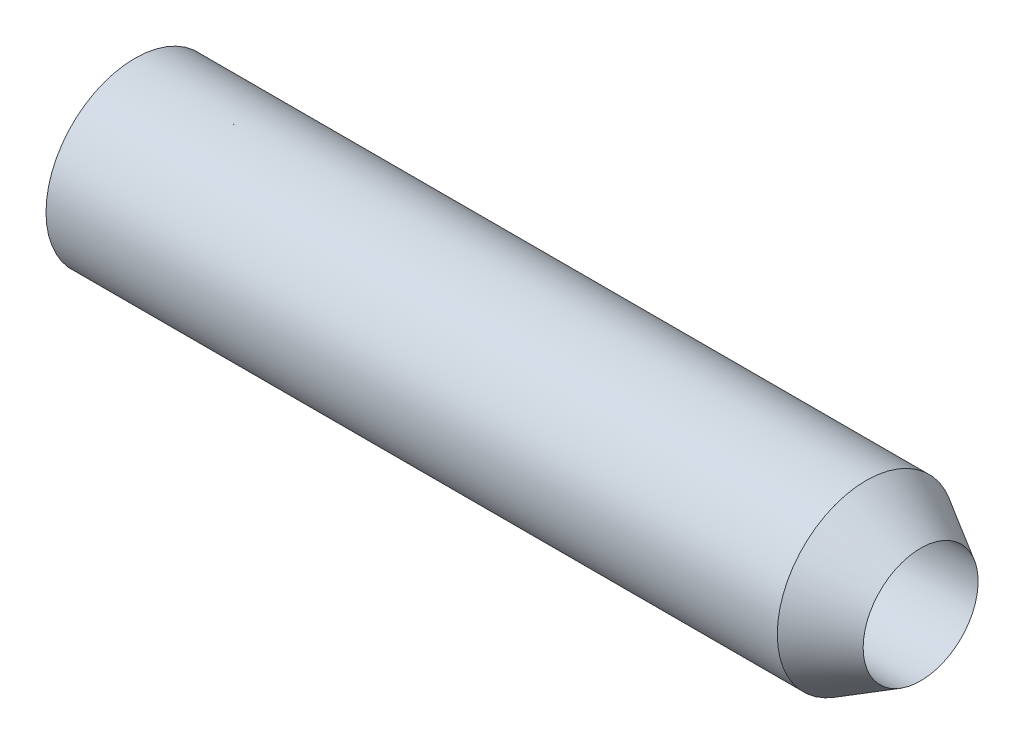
ISO-10303-21;
HEADER;
FILE_DESCRIPTION(('STEP AP214'),'2;1');
FILE_NAME('part.step','',(''),(''),'','','');
FILE_SCHEMA(('AUTOMOTIVE_DESIGN { 1 0 10303 214 1 1 1 1 }'));
ENDSEC;
DATA;
#1=APPLICATION_CONTEXT('core data for automotive mechanical design processes');
#2=APPLICATION_PROTOCOL_DEFINITION('international standard','automotive_design',2000,#1);
#3=PRODUCT_CONTEXT('',#1,'mechanical');
#4=PRODUCT('Part','Part','',(#3));
#5=PRODUCT_RELATED_PRODUCT_CATEGORY('part','',(#4));
#6=PRODUCT_DEFINITION_FORMATION('','',#4);
#7=PRODUCT_DEFINITION_CONTEXT('part definition',#1,'design');
#8=PRODUCT_DEFINITION('design','',#6,#7);
#9=PRODUCT_DEFINITION_SHAPE('','',#8);
#10=(LENGTH_UNIT() NAMED_UNIT(*) SI_UNIT(.MILLI.,.METRE.));
#11=(NAMED_UNIT(*) PLANE_ANGLE_UNIT() SI_UNIT($,.RADIAN.));
#12=(NAMED_UNIT(*) SI_UNIT($,.STERADIAN.) SOLID_ANGLE_UNIT());
#13=UNCERTAINTY_MEASURE_WITH_UNIT(LENGTH_MEASURE(1.E-05),#10,'distance_accuracy_value','');
#14=(GEOMETRIC_REPRESENTATION_CONTEXT(3) GLOBAL_UNCERTAINTY_ASSIGNED_CONTEXT((#13)) GLOBAL_UNIT_ASSIGNED_CONTEXT((#10,
#11,#12)) REPRESENTATION_CONTEXT('',''));
#15=CARTESIAN_POINT('',(0.,0.,0.));
#16=DIRECTION('',(0.,0.,1.));
#17=DIRECTION('',(1.,0.,0.));
#18=AXIS2_PLACEMENT_3D('',#15,#16,#17);
#19=CARTESIAN_POINT('',(21.0247582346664,0.,0.));
#20=DIRECTION('',(-1.,0.,0.));
#21=DIRECTION('',(0.,0.,1.));
#22=AXIS2_PLACEMENT_3D('',#19,#20,#21);
#23=CYLINDRICAL_SURFACE('',#22,3.65813100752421);
#24=CARTESIAN_POINT('',(120.,0.,0.));
#25=DIRECTION('',(1.,0.,0.));
#26=DIRECTION('',(0.,0.,-1.));
#27=AXIS2_PLACEMENT_3D('',#24,#25,#26);
#28=CIRCLE('',#27,3.65813100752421);
#29=CARTESIAN_POINT('',(120.,0.,-3.65813100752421));
#30=VERTEX_POINT('',#29);
#31=EDGE_CURVE('E55',#30,#30,#28,.F.);
#32=ORIENTED_EDGE('',*,*,#31,.T.);
#33=EDGE_LOOP('',(#32));
#34=FACE_BOUND('',#33,.T.);
#35=CARTESIAN_POINT('',(170.,0.,0.));
#36=DIRECTION('',(-1.,0.,0.));
#37=DIRECTION('',(0.,0.,1.));
#38=AXIS2_PLACEMENT_3D('',#35,#36,#37);
#39=CIRCLE('',#38,3.65813100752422);
#40=CARTESIAN_POINT('',(170.,0.,3.65813100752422));
#41=VERTEX_POINT('',#40);
#42=EDGE_CURVE('E11',#41,#41,#39,.T.);
#43=ORIENTED_EDGE('',*,*,#42,.F.);
#44=EDGE_LOOP('',(#43));
#45=FACE_BOUND('',#44,.T.);
#46=ADVANCED_FACE('F42',(#34,#45),#23,.F.);
#47=CARTESIAN_POINT('',(21.0247582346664,0.,0.));
#48=DIRECTION('',(-1.,0.,0.));
#49=DIRECTION('',(0.,0.,1.));
#50=AXIS2_PLACEMENT_3D('',#47,#48,#49);
#51=CYLINDRICAL_SURFACE('',#50,5.65813100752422);
#52=CARTESIAN_POINT('',(120.,0.,0.));
#53=DIRECTION('',(1.,0.,0.));
#54=DIRECTION('',(0.,0.,-1.));
#55=AXIS2_PLACEMENT_3D('',#52,#53,#54);
#56=CIRCLE('',#55,5.65813100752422);
#57=CARTESIAN_POINT('',(120.,0.,-5.65813100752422));
#58=VERTEX_POINT('',#57);
#59=EDGE_CURVE('E45',#58,#58,#56,.T.);
#60=ORIENTED_EDGE('',*,*,#59,.T.);
#61=EDGE_LOOP('',(#60));
#62=FACE_BOUND('',#61,.T.);
#63=CARTESIAN_POINT('',(166.535898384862,0.,0.));
#64=DIRECTION('',(-1.,0.,0.));
#65=DIRECTION('',(0.,0.,1.));
#66=AXIS2_PLACEMENT_3D('',#63,#64,#65);
#67=CIRCLE('',#66,5.65813100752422);
#68=CARTESIAN_POINT('',(166.535898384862,0.,5.65813100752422));
#69=VERTEX_POINT('',#68);
#70=EDGE_CURVE('E50',#69,#69,#67,.T.);
#71=ORIENTED_EDGE('',*,*,#70,.T.);
#72=EDGE_LOOP('',(#71));
#73=FACE_BOUND('',#72,.T.);
#74=ADVANCED_FACE('F66',(#62,#73),#51,.T.);
#75=CARTESIAN_POINT('',(170.,0.,0.));
#76=DIRECTION('',(-1.,0.,0.));
#77=DIRECTION('',(0.,0.,1.));
#78=AXIS2_PLACEMENT_3D('',#75,#76,#77);
#79=CONICAL_SURFACE('',#78,3.65813100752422,0.5235987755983);
#80=ORIENTED_EDGE('',*,*,#70,.F.);
#81=EDGE_LOOP('',(#80));
#82=FACE_BOUND('',#81,.T.);
#83=ORIENTED_EDGE('',*,*,#42,.T.);
#84=EDGE_LOOP('',(#83));
#85=FACE_BOUND('',#84,.T.);
#86=ADVANCED_FACE('F72',(#82,#85),#79,.T.);
#87=CARTESIAN_POINT('',(120.,0.,0.));
#88=DIRECTION('',(1.,0.,0.));
#89=DIRECTION('',(0.,0.,-1.));
#90=AXIS2_PLACEMENT_3D('',#87,#88,#89);
#91=PLANE('',#90);
#92=ORIENTED_EDGE('',*,*,#59,.F.);
#93=EDGE_LOOP('',(#92));
#94=FACE_BOUND('',#93,.T.);
#95=ORIENTED_EDGE('',*,*,#31,.F.);
#96=EDGE_LOOP('',(#95));
#97=FACE_BOUND('',#96,.T.);
#98=ADVANCED_FACE('F69',(#94,#97),#91,.F.);
#99=CLOSED_SHELL('',(#46,#74,#86,#98));
#100=MANIFOLD_SOLID_BREP('B2',#99);
#101=ADVANCED_BREP_SHAPE_REPRESENTATION('',(#18,#100),#14);
#102=SHAPE_DEFINITION_REPRESENTATION(#9,#101);
ENDSEC;
END-ISO-10303-21;
